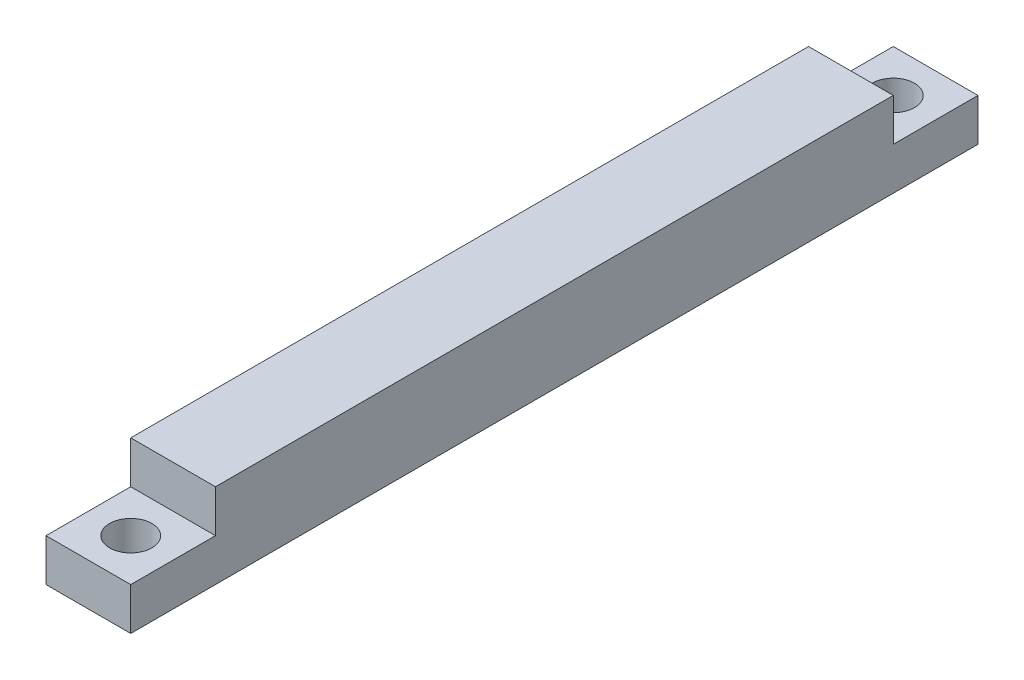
ISO-10303-21;
HEADER;
FILE_DESCRIPTION(('STEP AP214'),'2;1');
FILE_NAME('part.step','',(''),(''),'','','');
FILE_SCHEMA(('AUTOMOTIVE_DESIGN { 1 0 10303 214 1 1 1 1 }'));
ENDSEC;
DATA;
#1=APPLICATION_CONTEXT('core data for automotive mechanical design processes');
#2=APPLICATION_PROTOCOL_DEFINITION('international standard','automotive_design',2000,#1);
#3=PRODUCT_CONTEXT('',#1,'mechanical');
#4=PRODUCT('Part','Part','',(#3));
#5=PRODUCT_RELATED_PRODUCT_CATEGORY('part','',(#4));
#6=PRODUCT_DEFINITION_FORMATION('','',#4);
#7=PRODUCT_DEFINITION_CONTEXT('part definition',#1,'design');
#8=PRODUCT_DEFINITION('design','',#6,#7);
#9=PRODUCT_DEFINITION_SHAPE('','',#8);
#10=(LENGTH_UNIT() NAMED_UNIT(*) SI_UNIT(.MILLI.,.METRE.));
#11=(NAMED_UNIT(*) PLANE_ANGLE_UNIT() SI_UNIT($,.RADIAN.));
#12=(NAMED_UNIT(*) SI_UNIT($,.STERADIAN.) SOLID_ANGLE_UNIT());
#13=UNCERTAINTY_MEASURE_WITH_UNIT(LENGTH_MEASURE(1.E-05),#10,'distance_accuracy_value','');
#14=(GEOMETRIC_REPRESENTATION_CONTEXT(3) GLOBAL_UNCERTAINTY_ASSIGNED_CONTEXT((#13)) GLOBAL_UNIT_ASSIGNED_CONTEXT((#10,
#11,#12)) REPRESENTATION_CONTEXT('',''));
#15=CARTESIAN_POINT('',(0.,0.,0.));
#16=DIRECTION('',(0.,0.,1.));
#17=DIRECTION('',(1.,0.,0.));
#18=AXIS2_PLACEMENT_3D('',#15,#16,#17);
#19=CARTESIAN_POINT('',(0.,0.,0.));
#20=DIRECTION('',(0.,0.,1.));
#21=DIRECTION('',(1.,0.,0.));
#22=AXIS2_PLACEMENT_3D('',#19,#20,#21);
#23=PLANE('',#22);
#24=DIRECTION('',(1.,0.,0.));
#25=VECTOR('',#24,1.);
#26=CARTESIAN_POINT('',(-21.1803398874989,5.,0.));
#27=LINE('',#26,#25);
#28=CARTESIAN_POINT('',(-10.,5.,0.));
#29=VERTEX_POINT('',#28);
#30=CARTESIAN_POINT('',(0.,5.,0.));
#31=VERTEX_POINT('',#30);
#32=EDGE_CURVE('E50',#29,#31,#27,.T.);
#33=ORIENTED_EDGE('',*,*,#32,.F.);
#34=DIRECTION('',(0.,-1.,0.));
#35=VECTOR('',#34,1.);
#36=CARTESIAN_POINT('',(-10.,0.,0.));
#37=LINE('',#36,#35);
#38=CARTESIAN_POINT('',(-10.,10.,0.));
#39=VERTEX_POINT('',#38);
#40=EDGE_CURVE('E141',#39,#29,#37,.T.);
#41=ORIENTED_EDGE('',*,*,#40,.F.);
#42=DIRECTION('',(-1.,0.,0.));
#43=VECTOR('',#42,1.);
#44=CARTESIAN_POINT('',(0.,10.,0.));
#45=LINE('',#44,#43);
#46=CARTESIAN_POINT('',(0.,10.,0.));
#47=VERTEX_POINT('',#46);
#48=EDGE_CURVE('E158',#47,#39,#45,.T.);
#49=ORIENTED_EDGE('',*,*,#48,.F.);
#50=DIRECTION('',(0.,1.,0.));
#51=VECTOR('',#50,1.);
#52=CARTESIAN_POINT('',(0.,0.,0.));
#53=LINE('',#52,#51);
#54=EDGE_CURVE('E155',#31,#47,#53,.T.);
#55=ORIENTED_EDGE('',*,*,#54,.F.);
#56=EDGE_LOOP('',(#33,#41,#49,#55));
#57=FACE_BOUND('',#56,.T.);
#58=ADVANCED_FACE('F33',(#57),#23,.F.);
#59=CARTESIAN_POINT('',(0.,0.,80.));
#60=DIRECTION('',(0.,0.,1.));
#61=DIRECTION('',(1.,0.,0.));
#62=AXIS2_PLACEMENT_3D('',#59,#60,#61);
#63=PLANE('',#62);
#64=DIRECTION('',(0.,-1.,0.));
#65=VECTOR('',#64,1.);
#66=CARTESIAN_POINT('',(-10.,0.,80.));
#67=LINE('',#66,#65);
#68=CARTESIAN_POINT('',(-10.,10.,80.));
#69=VERTEX_POINT('',#68);
#70=CARTESIAN_POINT('',(-10.,5.,80.));
#71=VERTEX_POINT('',#70);
#72=EDGE_CURVE('E114',#69,#71,#67,.T.);
#73=ORIENTED_EDGE('',*,*,#72,.T.);
#74=DIRECTION('',(1.,0.,0.));
#75=VECTOR('',#74,1.);
#76=CARTESIAN_POINT('',(-21.1803398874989,5.,80.));
#77=LINE('',#76,#75);
#78=CARTESIAN_POINT('',(0.,5.,80.));
#79=VERTEX_POINT('',#78);
#80=EDGE_CURVE('E184',#71,#79,#77,.T.);
#81=ORIENTED_EDGE('',*,*,#80,.T.);
#82=DIRECTION('',(0.,1.,0.));
#83=VECTOR('',#82,1.);
#84=CARTESIAN_POINT('',(0.,0.,80.));
#85=LINE('',#84,#83);
#86=CARTESIAN_POINT('',(0.,10.,80.));
#87=VERTEX_POINT('',#86);
#88=EDGE_CURVE('E170',#79,#87,#85,.T.);
#89=ORIENTED_EDGE('',*,*,#88,.T.);
#90=DIRECTION('',(-1.,0.,0.));
#91=VECTOR('',#90,1.);
#92=CARTESIAN_POINT('',(0.,10.,80.));
#93=LINE('',#92,#91);
#94=EDGE_CURVE('E166',#87,#69,#93,.T.);
#95=ORIENTED_EDGE('',*,*,#94,.T.);
#96=EDGE_LOOP('',(#73,#81,#89,#95));
#97=FACE_BOUND('',#96,.T.);
#98=ADVANCED_FACE('F198',(#97),#63,.T.);
#99=CARTESIAN_POINT('',(0.,0.,80.));
#100=DIRECTION('',(-1.,0.,0.));
#101=DIRECTION('',(0.,-1.,0.));
#102=AXIS2_PLACEMENT_3D('',#99,#100,#101);
#103=PLANE('',#102);
#104=DIRECTION('',(0.,0.,-1.));
#105=VECTOR('',#104,1.);
#106=CARTESIAN_POINT('',(0.,0.,80.));
#107=LINE('',#106,#105);
#108=CARTESIAN_POINT('',(0.,0.,90.));
#109=VERTEX_POINT('',#108);
#110=CARTESIAN_POINT('',(0.,0.,-10.));
#111=VERTEX_POINT('',#110);
#112=EDGE_CURVE('E102',#109,#111,#107,.T.);
#113=ORIENTED_EDGE('',*,*,#112,.T.);
#114=DIRECTION('',(0.,1.,0.));
#115=VECTOR('',#114,1.);
#116=CARTESIAN_POINT('',(0.,0.,-10.));
#117=LINE('',#116,#115);
#118=CARTESIAN_POINT('',(0.,5.,-10.));
#119=VERTEX_POINT('',#118);
#120=EDGE_CURVE('E106',#111,#119,#117,.T.);
#121=ORIENTED_EDGE('',*,*,#120,.T.);
#122=DIRECTION('',(0.,0.,1.));
#123=VECTOR('',#122,1.);
#124=CARTESIAN_POINT('',(0.,5.,0.));
#125=LINE('',#124,#123);
#126=EDGE_CURVE('E123',#119,#31,#125,.T.);
#127=ORIENTED_EDGE('',*,*,#126,.T.);
#128=ORIENTED_EDGE('',*,*,#54,.T.);
#129=DIRECTION('',(0.,0.,-1.));
#130=VECTOR('',#129,1.);
#131=CARTESIAN_POINT('',(0.,10.,80.));
#132=LINE('',#131,#130);
#133=EDGE_CURVE('E11',#87,#47,#132,.T.);
#134=ORIENTED_EDGE('',*,*,#133,.F.);
#135=ORIENTED_EDGE('',*,*,#88,.F.);
#136=DIRECTION('',(0.,0.,1.));
#137=VECTOR('',#136,1.);
#138=CARTESIAN_POINT('',(0.,5.,80.));
#139=LINE('',#138,#137);
#140=CARTESIAN_POINT('',(0.,5.,90.));
#141=VERTEX_POINT('',#140);
#142=EDGE_CURVE('E58',#79,#141,#139,.T.);
#143=ORIENTED_EDGE('',*,*,#142,.T.);
#144=DIRECTION('',(0.,-1.,0.));
#145=VECTOR('',#144,1.);
#146=CARTESIAN_POINT('',(0.,5.,90.));
#147=LINE('',#146,#145);
#148=EDGE_CURVE('E109',#141,#109,#147,.T.);
#149=ORIENTED_EDGE('',*,*,#148,.T.);
#150=EDGE_LOOP('',(#113,#121,#127,#128,#134,#135,#143,#149));
#151=FACE_BOUND('',#150,.T.);
#152=ADVANCED_FACE('F35',(#151),#103,.F.);
#153=CARTESIAN_POINT('',(0.,10.,80.));
#154=DIRECTION('',(0.,-1.,0.));
#155=DIRECTION('',(1.,0.,0.));
#156=AXIS2_PLACEMENT_3D('',#153,#154,#155);
#157=PLANE('',#156);
#158=ORIENTED_EDGE('',*,*,#48,.T.);
#159=DIRECTION('',(0.,0.,-1.));
#160=VECTOR('',#159,1.);
#161=CARTESIAN_POINT('',(-10.,10.,80.));
#162=LINE('',#161,#160);
#163=EDGE_CURVE('E42',#69,#39,#162,.T.);
#164=ORIENTED_EDGE('',*,*,#163,.F.);
#165=ORIENTED_EDGE('',*,*,#94,.F.);
#166=ORIENTED_EDGE('',*,*,#133,.T.);
#167=EDGE_LOOP('',(#158,#164,#165,#166));
#168=FACE_BOUND('',#167,.T.);
#169=ADVANCED_FACE('F165',(#168),#157,.F.);
#170=CARTESIAN_POINT('',(-10.,0.,80.));
#171=DIRECTION('',(1.,0.,0.));
#172=DIRECTION('',(0.,0.,-1.));
#173=AXIS2_PLACEMENT_3D('',#170,#171,#172);
#174=PLANE('',#173);
#175=ORIENTED_EDGE('',*,*,#40,.T.);
#176=DIRECTION('',(0.,0.,-1.));
#177=VECTOR('',#176,1.);
#178=CARTESIAN_POINT('',(-10.,5.,0.));
#179=LINE('',#178,#177);
#180=CARTESIAN_POINT('',(-10.,5.,-10.));
#181=VERTEX_POINT('',#180);
#182=EDGE_CURVE('E146',#29,#181,#179,.T.);
#183=ORIENTED_EDGE('',*,*,#182,.T.);
#184=DIRECTION('',(0.,-1.,0.));
#185=VECTOR('',#184,1.);
#186=CARTESIAN_POINT('',(-10.,0.,-10.));
#187=LINE('',#186,#185);
#188=CARTESIAN_POINT('',(-10.,0.,-10.));
#189=VERTEX_POINT('',#188);
#190=EDGE_CURVE('E135',#181,#189,#187,.T.);
#191=ORIENTED_EDGE('',*,*,#190,.T.);
#192=DIRECTION('',(0.,0.,-1.));
#193=VECTOR('',#192,1.);
#194=CARTESIAN_POINT('',(-10.,0.,80.));
#195=LINE('',#194,#193);
#196=CARTESIAN_POINT('',(-10.,0.,90.));
#197=VERTEX_POINT('',#196);
#198=EDGE_CURVE('E113',#197,#189,#195,.T.);
#199=ORIENTED_EDGE('',*,*,#198,.F.);
#200=DIRECTION('',(0.,1.,0.));
#201=VECTOR('',#200,1.);
#202=CARTESIAN_POINT('',(-10.,5.,90.));
#203=LINE('',#202,#201);
#204=CARTESIAN_POINT('',(-10.,5.,90.));
#205=VERTEX_POINT('',#204);
#206=EDGE_CURVE('E193',#197,#205,#203,.T.);
#207=ORIENTED_EDGE('',*,*,#206,.T.);
#208=DIRECTION('',(0.,0.,-1.));
#209=VECTOR('',#208,1.);
#210=CARTESIAN_POINT('',(-10.,5.,80.));
#211=LINE('',#210,#209);
#212=EDGE_CURVE('E159',#205,#71,#211,.T.);
#213=ORIENTED_EDGE('',*,*,#212,.T.);
#214=ORIENTED_EDGE('',*,*,#72,.F.);
#215=ORIENTED_EDGE('',*,*,#163,.T.);
#216=EDGE_LOOP('',(#175,#183,#191,#199,#207,#213,#214,#215));
#217=FACE_BOUND('',#216,.T.);
#218=ADVANCED_FACE('F150',(#217),#174,.F.);
#219=CARTESIAN_POINT('',(0.,0.,80.));
#220=DIRECTION('',(0.,1.,0.));
#221=DIRECTION('',(0.,0.,1.));
#222=AXIS2_PLACEMENT_3D('',#219,#220,#221);
#223=PLANE('',#222);
#224=CARTESIAN_POINT('',(-5.,0.,-5.));
#225=DIRECTION('',(0.,1.,0.));
#226=DIRECTION('',(0.,0.,1.));
#227=AXIS2_PLACEMENT_3D('',#224,#225,#226);
#228=CIRCLE('',#227,2.5);
#229=CARTESIAN_POINT('',(-5.,0.,-2.5));
#230=VERTEX_POINT('',#229);
#231=EDGE_CURVE('E323',#230,#230,#228,.T.);
#232=ORIENTED_EDGE('',*,*,#231,.T.);
#233=EDGE_LOOP('',(#232));
#234=FACE_BOUND('',#233,.T.);
#235=CARTESIAN_POINT('',(-5.,0.,85.));
#236=DIRECTION('',(0.,1.,0.));
#237=DIRECTION('',(0.,0.,1.));
#238=AXIS2_PLACEMENT_3D('',#235,#236,#237);
#239=CIRCLE('',#238,2.5);
#240=CARTESIAN_POINT('',(-5.,0.,87.5));
#241=VERTEX_POINT('',#240);
#242=EDGE_CURVE('E127',#241,#241,#239,.T.);
#243=ORIENTED_EDGE('',*,*,#242,.T.);
#244=EDGE_LOOP('',(#243));
#245=FACE_BOUND('',#244,.T.);
#246=ORIENTED_EDGE('',*,*,#198,.T.);
#247=DIRECTION('',(1.,0.,0.));
#248=VECTOR('',#247,1.);
#249=CARTESIAN_POINT('',(-21.1803398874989,0.,-10.));
#250=LINE('',#249,#248);
#251=EDGE_CURVE('E117',#189,#111,#250,.T.);
#252=ORIENTED_EDGE('',*,*,#251,.T.);
#253=ORIENTED_EDGE('',*,*,#112,.F.);
#254=DIRECTION('',(1.,0.,0.));
#255=VECTOR('',#254,1.);
#256=CARTESIAN_POINT('',(-21.1803398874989,0.,90.));
#257=LINE('',#256,#255);
#258=EDGE_CURVE('E191',#197,#109,#257,.T.);
#259=ORIENTED_EDGE('',*,*,#258,.F.);
#260=EDGE_LOOP('',(#246,#252,#253,#259));
#261=FACE_BOUND('',#260,.T.);
#262=ADVANCED_FACE('F118',(#234,#245,#261),#223,.F.);
#263=CARTESIAN_POINT('',(-21.1803398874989,5.,90.));
#264=DIRECTION('',(0.,0.,1.));
#265=DIRECTION('',(1.,0.,0.));
#266=AXIS2_PLACEMENT_3D('',#263,#264,#265);
#267=PLANE('',#266);
#268=ORIENTED_EDGE('',*,*,#206,.F.);
#269=ORIENTED_EDGE('',*,*,#258,.T.);
#270=ORIENTED_EDGE('',*,*,#148,.F.);
#271=DIRECTION('',(1.,0.,0.));
#272=VECTOR('',#271,1.);
#273=CARTESIAN_POINT('',(-21.1803398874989,5.,90.));
#274=LINE('',#273,#272);
#275=EDGE_CURVE('E186',#205,#141,#274,.T.);
#276=ORIENTED_EDGE('',*,*,#275,.F.);
#277=EDGE_LOOP('',(#268,#269,#270,#276));
#278=FACE_BOUND('',#277,.T.);
#279=ADVANCED_FACE('F211',(#278),#267,.T.);
#280=CARTESIAN_POINT('',(-21.1803398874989,5.,80.));
#281=DIRECTION('',(0.,1.,0.));
#282=DIRECTION('',(0.,0.,1.));
#283=AXIS2_PLACEMENT_3D('',#280,#281,#282);
#284=PLANE('',#283);
#285=CARTESIAN_POINT('',(-5.,5.,85.));
#286=DIRECTION('',(0.,1.,0.));
#287=DIRECTION('',(0.,0.,1.));
#288=AXIS2_PLACEMENT_3D('',#285,#286,#287);
#289=CIRCLE('',#288,2.5);
#290=CARTESIAN_POINT('',(-5.,5.,87.5));
#291=VERTEX_POINT('',#290);
#292=EDGE_CURVE('E131',#291,#291,#289,.T.);
#293=ORIENTED_EDGE('',*,*,#292,.F.);
#294=EDGE_LOOP('',(#293));
#295=FACE_BOUND('',#294,.T.);
#296=ORIENTED_EDGE('',*,*,#212,.F.);
#297=ORIENTED_EDGE('',*,*,#275,.T.);
#298=ORIENTED_EDGE('',*,*,#142,.F.);
#299=ORIENTED_EDGE('',*,*,#80,.F.);
#300=EDGE_LOOP('',(#296,#297,#298,#299));
#301=FACE_BOUND('',#300,.T.);
#302=ADVANCED_FACE('F197',(#295,#301),#284,.T.);
#303=CARTESIAN_POINT('',(-21.1803398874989,5.,0.));
#304=DIRECTION('',(0.,1.,0.));
#305=DIRECTION('',(0.,0.,1.));
#306=AXIS2_PLACEMENT_3D('',#303,#304,#305);
#307=PLANE('',#306);
#308=CARTESIAN_POINT('',(-5.,5.00000000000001,-5.));
#309=DIRECTION('',(0.,1.,0.));
#310=DIRECTION('',(0.,0.,1.));
#311=AXIS2_PLACEMENT_3D('',#308,#309,#310);
#312=CIRCLE('',#311,2.5);
#313=CARTESIAN_POINT('',(-5.,5.00000000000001,-2.5));
#314=VERTEX_POINT('',#313);
#315=EDGE_CURVE('E326',#314,#314,#312,.T.);
#316=ORIENTED_EDGE('',*,*,#315,.F.);
#317=EDGE_LOOP('',(#316));
#318=FACE_BOUND('',#317,.T.);
#319=ORIENTED_EDGE('',*,*,#182,.F.);
#320=ORIENTED_EDGE('',*,*,#32,.T.);
#321=ORIENTED_EDGE('',*,*,#126,.F.);
#322=DIRECTION('',(1.,0.,0.));
#323=VECTOR('',#322,1.);
#324=CARTESIAN_POINT('',(-21.1803398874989,5.,-10.));
#325=LINE('',#324,#323);
#326=EDGE_CURVE('E122',#181,#119,#325,.T.);
#327=ORIENTED_EDGE('',*,*,#326,.F.);
#328=EDGE_LOOP('',(#319,#320,#321,#327));
#329=FACE_BOUND('',#328,.T.);
#330=ADVANCED_FACE('F153',(#318,#329),#307,.T.);
#331=CARTESIAN_POINT('',(-21.1803398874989,0.,-10.));
#332=DIRECTION('',(0.,0.,-1.));
#333=DIRECTION('',(-1.,0.,0.));
#334=AXIS2_PLACEMENT_3D('',#331,#332,#333);
#335=PLANE('',#334);
#336=ORIENTED_EDGE('',*,*,#190,.F.);
#337=ORIENTED_EDGE('',*,*,#326,.T.);
#338=ORIENTED_EDGE('',*,*,#120,.F.);
#339=ORIENTED_EDGE('',*,*,#251,.F.);
#340=EDGE_LOOP('',(#336,#337,#338,#339));
#341=FACE_BOUND('',#340,.T.);
#342=ADVANCED_FACE('F125',(#341),#335,.T.);
#343=CARTESIAN_POINT('',(-5.,0.,85.));
#344=DIRECTION('',(0.,1.,0.));
#345=DIRECTION('',(0.,0.,1.));
#346=AXIS2_PLACEMENT_3D('',#343,#344,#345);
#347=CYLINDRICAL_SURFACE('',#346,2.5);
#348=CARTESIAN_POINT('',(-5.,0.,87.5));
#349=CARTESIAN_POINT('',(-5.,0.0520833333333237,87.5));
#350=CARTESIAN_POINT('',(-5.,0.104166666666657,87.5));
#351=CARTESIAN_POINT('',(-5.,0.208333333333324,87.5));
#352=CARTESIAN_POINT('',(-5.,0.260416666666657,87.5));
#353=CARTESIAN_POINT('',(-5.,0.364583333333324,87.5));
#354=CARTESIAN_POINT('',(-5.,0.416666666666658,87.5));
#355=CARTESIAN_POINT('',(-5.,0.520833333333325,87.5));
#356=CARTESIAN_POINT('',(-5.,0.572916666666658,87.5));
#357=CARTESIAN_POINT('',(-5.,0.677083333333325,87.5));
#358=CARTESIAN_POINT('',(-5.,0.729166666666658,87.5));
#359=CARTESIAN_POINT('',(-5.,0.833333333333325,87.5));
#360=CARTESIAN_POINT('',(-5.,0.885416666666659,87.5));
#361=CARTESIAN_POINT('',(-5.,0.989583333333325,87.5));
#362=CARTESIAN_POINT('',(-5.,1.04166666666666,87.5));
#363=CARTESIAN_POINT('',(-5.,1.14583333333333,87.5));
#364=CARTESIAN_POINT('',(-5.,1.19791666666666,87.5));
#365=CARTESIAN_POINT('',(-5.,1.30208333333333,87.5));
#366=CARTESIAN_POINT('',(-5.,1.35416666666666,87.5));
#367=CARTESIAN_POINT('',(-5.,1.45833333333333,87.5));
#368=CARTESIAN_POINT('',(-5.,1.51041666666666,87.5));
#369=CARTESIAN_POINT('',(-5.,1.61458333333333,87.5));
#370=CARTESIAN_POINT('',(-5.,1.66666666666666,87.5));
#371=CARTESIAN_POINT('',(-5.,1.77083333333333,87.5));
#372=CARTESIAN_POINT('',(-5.,1.82291666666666,87.5));
#373=CARTESIAN_POINT('',(-5.,1.92708333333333,87.5));
#374=CARTESIAN_POINT('',(-5.,1.97916666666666,87.5));
#375=CARTESIAN_POINT('',(-5.,2.08333333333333,87.5));
#376=CARTESIAN_POINT('',(-5.,2.13541666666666,87.5));
#377=CARTESIAN_POINT('',(-5.,2.23958333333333,87.5));
#378=CARTESIAN_POINT('',(-5.,2.29166666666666,87.5));
#379=CARTESIAN_POINT('',(-5.,2.39583333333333,87.5));
#380=CARTESIAN_POINT('',(-5.,2.44791666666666,87.5));
#381=CARTESIAN_POINT('',(-5.,2.55208333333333,87.5));
#382=CARTESIAN_POINT('',(-5.,2.60416666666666,87.5));
#383=CARTESIAN_POINT('',(-5.,2.70833333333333,87.5));
#384=CARTESIAN_POINT('',(-5.,2.76041666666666,87.5));
#385=CARTESIAN_POINT('',(-5.,2.86458333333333,87.5));
#386=CARTESIAN_POINT('',(-5.,2.91666666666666,87.5));
#387=CARTESIAN_POINT('',(-5.,3.02083333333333,87.5));
#388=CARTESIAN_POINT('',(-5.,3.07291666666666,87.5));
#389=CARTESIAN_POINT('',(-5.,3.17708333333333,87.5));
#390=CARTESIAN_POINT('',(-5.,3.22916666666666,87.5));
#391=CARTESIAN_POINT('',(-5.,3.33333333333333,87.5));
#392=CARTESIAN_POINT('',(-5.,3.38541666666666,87.5));
#393=CARTESIAN_POINT('',(-5.,3.48958333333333,87.5));
#394=CARTESIAN_POINT('',(-5.,3.54166666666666,87.5));
#395=CARTESIAN_POINT('',(-5.,3.64583333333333,87.5));
#396=CARTESIAN_POINT('',(-5.,3.69791666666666,87.5));
#397=CARTESIAN_POINT('',(-5.,3.80208333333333,87.5));
#398=CARTESIAN_POINT('',(-5.,3.85416666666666,87.5));
#399=CARTESIAN_POINT('',(-5.,3.95833333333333,87.5));
#400=CARTESIAN_POINT('',(-5.,4.01041666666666,87.5));
#401=CARTESIAN_POINT('',(-5.,4.11458333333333,87.5));
#402=CARTESIAN_POINT('',(-5.,4.16666666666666,87.5));
#403=CARTESIAN_POINT('',(-5.,4.27083333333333,87.5));
#404=CARTESIAN_POINT('',(-5.,4.32291666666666,87.5));
#405=CARTESIAN_POINT('',(-5.,4.42708333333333,87.5));
#406=CARTESIAN_POINT('',(-5.,4.47916666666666,87.5));
#407=CARTESIAN_POINT('',(-5.,4.58333333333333,87.5));
#408=CARTESIAN_POINT('',(-5.,4.63541666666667,87.5));
#409=CARTESIAN_POINT('',(-5.,4.73958333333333,87.5));
#410=CARTESIAN_POINT('',(-5.,4.79166666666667,87.5));
#411=CARTESIAN_POINT('',(-5.,4.89583333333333,87.5));
#412=CARTESIAN_POINT('',(-5.,4.94791666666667,87.5));
#413=CARTESIAN_POINT('',(-5.,5.,87.5));
#414=B_SPLINE_CURVE_WITH_KNOTS('',3,(#348,#349,#350,#351,#352,#353,#354,#355,#356,#357,#358,
#359,#360,#361,#362,#363,#364,#365,#366,#367,#368,#369,#370,#371,#372,#373,#374,#375,#376,#377,
#378,#379,#380,#381,#382,#383,#384,#385,#386,#387,#388,#389,#390,#391,#392,#393,#394,#395,#396,
#397,#398,#399,#400,#401,#402,#403,#404,#405,#406,#407,#408,#409,#410,#411,#412,#413),
.UNSPECIFIED.,.F.,.F.,(4,2,2,2,2,2,2,2,2,2,2,2,2,2,2,2,2,2,2,2,2,2,2,2,2,2,2,2,2,2,2,2,4),(0.,
0.15625,0.312500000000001,0.468750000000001,0.625000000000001,0.781250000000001,
0.937500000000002,1.09375,1.25,1.40625,1.5625,1.71875,1.875,2.03125,2.1875,2.34375,2.5,2.65625,
2.8125,2.96875000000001,3.12500000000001,3.28125000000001,3.43750000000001,3.59375000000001,
3.75000000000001,3.90625000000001,4.06250000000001,4.21875000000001,4.37500000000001,
4.53125000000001,4.68750000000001,4.84375000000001,5.00000000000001),.UNSPECIFIED.);
#415=EDGE_CURVE('BSEAM254',#241,#291,#414,.T.);
#416=ORIENTED_EDGE('',*,*,#242,.F.);
#417=ORIENTED_EDGE('',*,*,#292,.T.);
#418=ORIENTED_EDGE('',*,*,#415,.T.);
#419=ORIENTED_EDGE('',*,*,#415,.F.);
#420=EDGE_LOOP('',(#416,#418,#417,#419));
#421=FACE_BOUND('',#420,.T.);
#422=ADVANCED_FACE('F254',(#421),#347,.F.);
#423=CARTESIAN_POINT('',(-5.,0.,-5.));
#424=DIRECTION('',(0.,1.,0.));
#425=DIRECTION('',(0.,0.,1.));
#426=AXIS2_PLACEMENT_3D('',#423,#424,#425);
#427=CYLINDRICAL_SURFACE('',#426,2.5);
#428=CARTESIAN_POINT('',(-5.,0.,-2.5));
#429=CARTESIAN_POINT('',(-5.,0.0520833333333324,-2.5));
#430=CARTESIAN_POINT('',(-5.,0.104166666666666,-2.5));
#431=CARTESIAN_POINT('',(-5.,0.208333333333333,-2.5));
#432=CARTESIAN_POINT('',(-5.,0.260416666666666,-2.5));
#433=CARTESIAN_POINT('',(-5.,0.364583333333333,-2.5));
#434=CARTESIAN_POINT('',(-5.,0.416666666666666,-2.5));
#435=CARTESIAN_POINT('',(-5.,0.520833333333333,-2.5));
#436=CARTESIAN_POINT('',(-5.,0.572916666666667,-2.5));
#437=CARTESIAN_POINT('',(-5.,0.677083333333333,-2.5));
#438=CARTESIAN_POINT('',(-5.,0.729166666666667,-2.5));
#439=CARTESIAN_POINT('',(-5.,0.833333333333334,-2.5));
#440=CARTESIAN_POINT('',(-5.,0.885416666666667,-2.5));
#441=CARTESIAN_POINT('',(-5.,0.989583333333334,-2.5));
#442=CARTESIAN_POINT('',(-5.,1.04166666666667,-2.5));
#443=CARTESIAN_POINT('',(-5.,1.14583333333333,-2.5));
#444=CARTESIAN_POINT('',(-5.,1.19791666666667,-2.5));
#445=CARTESIAN_POINT('',(-5.,1.30208333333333,-2.5));
#446=CARTESIAN_POINT('',(-5.,1.35416666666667,-2.5));
#447=CARTESIAN_POINT('',(-5.,1.45833333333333,-2.5));
#448=CARTESIAN_POINT('',(-5.,1.51041666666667,-2.5));
#449=CARTESIAN_POINT('',(-5.,1.61458333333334,-2.5));
#450=CARTESIAN_POINT('',(-5.,1.66666666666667,-2.5));
#451=CARTESIAN_POINT('',(-5.,1.77083333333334,-2.5));
#452=CARTESIAN_POINT('',(-5.,1.82291666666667,-2.5));
#453=CARTESIAN_POINT('',(-5.,1.92708333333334,-2.5));
#454=CARTESIAN_POINT('',(-5.,1.97916666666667,-2.5));
#455=CARTESIAN_POINT('',(-5.,2.08333333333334,-2.5));
#456=CARTESIAN_POINT('',(-5.,2.13541666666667,-2.5));
#457=CARTESIAN_POINT('',(-5.,2.23958333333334,-2.5));
#458=CARTESIAN_POINT('',(-5.,2.29166666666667,-2.5));
#459=CARTESIAN_POINT('',(-5.,2.39583333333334,-2.5));
#460=CARTESIAN_POINT('',(-5.,2.44791666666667,-2.5));
#461=CARTESIAN_POINT('',(-5.,2.55208333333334,-2.5));
#462=CARTESIAN_POINT('',(-5.,2.60416666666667,-2.5));
#463=CARTESIAN_POINT('',(-5.,2.70833333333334,-2.5));
#464=CARTESIAN_POINT('',(-5.,2.76041666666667,-2.5));
#465=CARTESIAN_POINT('',(-5.,2.86458333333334,-2.5));
#466=CARTESIAN_POINT('',(-5.,2.91666666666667,-2.5));
#467=CARTESIAN_POINT('',(-5.,3.02083333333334,-2.5));
#468=CARTESIAN_POINT('',(-5.,3.07291666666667,-2.5));
#469=CARTESIAN_POINT('',(-5.,3.17708333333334,-2.5));
#470=CARTESIAN_POINT('',(-5.,3.22916666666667,-2.5));
#471=CARTESIAN_POINT('',(-5.,3.33333333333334,-2.5));
#472=CARTESIAN_POINT('',(-5.,3.38541666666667,-2.5));
#473=CARTESIAN_POINT('',(-5.,3.48958333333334,-2.5));
#474=CARTESIAN_POINT('',(-5.,3.54166666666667,-2.5));
#475=CARTESIAN_POINT('',(-5.,3.64583333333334,-2.5));
#476=CARTESIAN_POINT('',(-5.,3.69791666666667,-2.5));
#477=CARTESIAN_POINT('',(-5.,3.80208333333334,-2.5));
#478=CARTESIAN_POINT('',(-5.,3.85416666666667,-2.5));
#479=CARTESIAN_POINT('',(-5.,3.95833333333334,-2.5));
#480=CARTESIAN_POINT('',(-5.,4.01041666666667,-2.5));
#481=CARTESIAN_POINT('',(-5.,4.11458333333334,-2.5));
#482=CARTESIAN_POINT('',(-5.,4.16666666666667,-2.5));
#483=CARTESIAN_POINT('',(-5.,4.27083333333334,-2.5));
#484=CARTESIAN_POINT('',(-5.,4.32291666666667,-2.5));
#485=CARTESIAN_POINT('',(-5.,4.42708333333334,-2.5));
#486=CARTESIAN_POINT('',(-5.,4.47916666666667,-2.5));
#487=CARTESIAN_POINT('',(-5.,4.58333333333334,-2.5));
#488=CARTESIAN_POINT('',(-5.,4.63541666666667,-2.5));
#489=CARTESIAN_POINT('',(-5.,4.73958333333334,-2.5));
#490=CARTESIAN_POINT('',(-5.,4.79166666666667,-2.5));
#491=CARTESIAN_POINT('',(-5.,4.89583333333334,-2.5));
#492=CARTESIAN_POINT('',(-5.,4.94791666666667,-2.5));
#493=CARTESIAN_POINT('',(-5.,5.00000000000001,-2.5));
#494=B_SPLINE_CURVE_WITH_KNOTS('',3,(#428,#429,#430,#431,#432,#433,#434,#435,#436,#437,#438,
#439,#440,#441,#442,#443,#444,#445,#446,#447,#448,#449,#450,#451,#452,#453,#454,#455,#456,#457,
#458,#459,#460,#461,#462,#463,#464,#465,#466,#467,#468,#469,#470,#471,#472,#473,#474,#475,#476,
#477,#478,#479,#480,#481,#482,#483,#484,#485,#486,#487,#488,#489,#490,#491,#492,#493),
.UNSPECIFIED.,.F.,.F.,(4,2,2,2,2,2,2,2,2,2,2,2,2,2,2,2,2,2,2,2,2,2,2,2,2,2,2,2,2,2,2,2,4),(0.,
0.15625,0.312500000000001,0.468750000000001,0.625000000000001,0.781250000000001,
0.937500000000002,1.09375,1.25,1.40625,1.5625,1.71875,1.875,2.03125,2.1875,2.34375,2.5,2.65625,
2.8125,2.96875000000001,3.12500000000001,3.28125000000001,3.43750000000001,3.59375000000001,
3.75000000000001,3.90625000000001,4.06250000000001,4.21875000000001,4.37500000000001,
4.53125000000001,4.68750000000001,4.84375000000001,5.00000000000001),.UNSPECIFIED.);
#495=EDGE_CURVE('BSEAM260',#230,#314,#494,.T.);
#496=ORIENTED_EDGE('',*,*,#231,.F.);
#497=ORIENTED_EDGE('',*,*,#315,.T.);
#498=ORIENTED_EDGE('',*,*,#495,.T.);
#499=ORIENTED_EDGE('',*,*,#495,.F.);
#500=EDGE_LOOP('',(#496,#498,#497,#499));
#501=FACE_BOUND('',#500,.T.);
#502=ADVANCED_FACE('F260',(#501),#427,.F.);
#503=CLOSED_SHELL('',(#58,#98,#152,#169,#218,#262,#279,#302,#330,#342,#422,#502));
#504=MANIFOLD_SOLID_BREP('B2',#503);
#505=ADVANCED_BREP_SHAPE_REPRESENTATION('',(#18,#504),#14);
#506=SHAPE_DEFINITION_REPRESENTATION(#9,#505);
ENDSEC;
END-ISO-10303-21;
